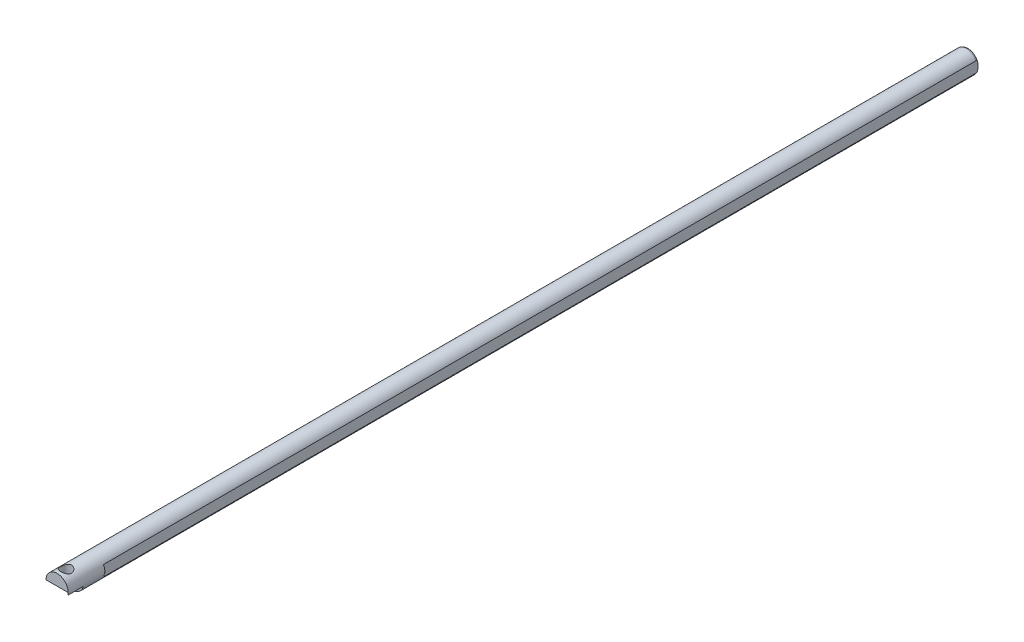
ISO-10303-21;
HEADER;
FILE_DESCRIPTION(('STEP AP214'),'2;1');
FILE_NAME('part.step','',(''),(''),'','','');
FILE_SCHEMA(('AUTOMOTIVE_DESIGN { 1 0 10303 214 1 1 1 1 }'));
ENDSEC;
DATA;
#1=APPLICATION_CONTEXT('core data for automotive mechanical design processes');
#2=APPLICATION_PROTOCOL_DEFINITION('international standard','automotive_design',2000,#1);
#3=PRODUCT_CONTEXT('',#1,'mechanical');
#4=PRODUCT('Part','Part','',(#3));
#5=PRODUCT_RELATED_PRODUCT_CATEGORY('part','',(#4));
#6=PRODUCT_DEFINITION_FORMATION('','',#4);
#7=PRODUCT_DEFINITION_CONTEXT('part definition',#1,'design');
#8=PRODUCT_DEFINITION('design','',#6,#7);
#9=PRODUCT_DEFINITION_SHAPE('','',#8);
#10=(LENGTH_UNIT() NAMED_UNIT(*) SI_UNIT(.MILLI.,.METRE.));
#11=(NAMED_UNIT(*) PLANE_ANGLE_UNIT() SI_UNIT($,.RADIAN.));
#12=(NAMED_UNIT(*) SI_UNIT($,.STERADIAN.) SOLID_ANGLE_UNIT());
#13=UNCERTAINTY_MEASURE_WITH_UNIT(LENGTH_MEASURE(1.E-05),#10,'distance_accuracy_value','');
#14=(GEOMETRIC_REPRESENTATION_CONTEXT(3) GLOBAL_UNCERTAINTY_ASSIGNED_CONTEXT((#13)) GLOBAL_UNIT_ASSIGNED_CONTEXT((#10,
#11,#12)) REPRESENTATION_CONTEXT('',''));
#15=CARTESIAN_POINT('',(0.,0.,0.));
#16=DIRECTION('',(0.,0.,1.));
#17=DIRECTION('',(1.,0.,0.));
#18=AXIS2_PLACEMENT_3D('',#15,#16,#17);
#19=CARTESIAN_POINT('',(0.,0.,82.));
#20=DIRECTION('',(0.,0.,-1.));
#21=DIRECTION('',(-1.,0.,0.));
#22=AXIS2_PLACEMENT_3D('',#19,#20,#21);
#23=CYLINDRICAL_SURFACE('',#22,0.999999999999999);
#24=CARTESIAN_POINT('',(0.,0.,82.));
#25=DIRECTION('',(0.,0.,1.));
#26=DIRECTION('',(1.,0.,0.));
#27=AXIS2_PLACEMENT_3D('',#24,#25,#26);
#28=CIRCLE('',#27,0.999999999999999);
#29=CARTESIAN_POINT('',(0.976913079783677,-0.213637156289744,82.));
#30=VERTEX_POINT('',#29);
#31=CARTESIAN_POINT('',(-0.999999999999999,0.,82.));
#32=VERTEX_POINT('',#31);
#33=EDGE_CURVE('E136',#30,#32,#28,.T.);
#34=ORIENTED_EDGE('',*,*,#33,.F.);
#35=DIRECTION('',(0.,0.,-1.));
#36=VECTOR('',#35,1.);
#37=CARTESIAN_POINT('',(0.976913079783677,-0.213637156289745,82.));
#38=LINE('',#37,#36);
#39=CARTESIAN_POINT('',(0.976913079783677,-0.213637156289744,80.6200613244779));
#40=VERTEX_POINT('',#39);
#41=EDGE_CURVE('E132',#30,#40,#38,.T.);
#42=ORIENTED_EDGE('',*,*,#41,.T.);
#43=CARTESIAN_POINT('',(0.,0.,80.6200613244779));
#44=DIRECTION('',(0.,0.,-1.));
#45=DIRECTION('',(-1.,0.,0.));
#46=AXIS2_PLACEMENT_3D('',#43,#44,#45);
#47=CIRCLE('',#46,0.999999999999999);
#48=CARTESIAN_POINT('',(-0.999999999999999,0.,80.6200613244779));
#49=VERTEX_POINT('',#48);
#50=EDGE_CURVE('E183',#40,#49,#47,.T.);
#51=ORIENTED_EDGE('',*,*,#50,.T.);
#52=DIRECTION('',(0.,0.,1.));
#53=VECTOR('',#52,1.);
#54=CARTESIAN_POINT('',(-0.999999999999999,0.,82.));
#55=LINE('',#54,#53);
#56=EDGE_CURVE('E117',#49,#32,#55,.T.);
#57=ORIENTED_EDGE('',*,*,#56,.T.);
#58=EDGE_LOOP('',(#34,#42,#51,#57));
#59=FACE_BOUND('',#58,.T.);
#60=CARTESIAN_POINT('',(0.,0.999999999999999,80.6998810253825));
#61=CARTESIAN_POINT('',(-0.0262859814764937,0.999998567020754,80.6998826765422));
#62=CARTESIAN_POINT('',(-0.0526032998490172,0.998952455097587,80.7019660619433));
#63=CARTESIAN_POINT('',(-0.104460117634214,0.99487078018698,80.7102074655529));
#64=CARTESIAN_POINT('',(-0.129998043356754,0.991831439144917,80.7163732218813));
#65=CARTESIAN_POINT('',(-0.179466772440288,0.984081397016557,80.7324779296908));
#66=CARTESIAN_POINT('',(-0.203403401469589,0.979377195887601,80.7424022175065));
#67=CARTESIAN_POINT('',(-0.249236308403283,0.968728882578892,80.7656663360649));
#68=CARTESIAN_POINT('',(-0.271132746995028,0.962784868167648,80.7790058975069));
#69=CARTESIAN_POINT('',(-0.31375390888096,0.949781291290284,80.8096396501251));
#70=CARTESIAN_POINT('',(-0.334327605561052,0.94267599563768,80.8271242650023));
#71=CARTESIAN_POINT('',(-0.372389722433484,0.928299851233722,80.865141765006));
#72=CARTESIAN_POINT('',(-0.389875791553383,0.921028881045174,80.8856769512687));
#73=CARTESIAN_POINT('',(-0.422626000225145,0.906494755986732,80.9311227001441));
#74=CARTESIAN_POINT('',(-0.437612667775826,0.899275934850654,80.9562490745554));
#75=CARTESIAN_POINT('',(-0.463084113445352,0.8864298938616,81.0090646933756));
#76=CARTESIAN_POINT('',(-0.473572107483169,0.880801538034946,81.0367520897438));
#77=CARTESIAN_POINT('',(-0.489066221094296,0.872289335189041,81.0922135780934));
#78=CARTESIAN_POINT('',(-0.494362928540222,0.869261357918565,81.1198832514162));
#79=CARTESIAN_POINT('',(-0.500213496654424,0.865909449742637,81.1758704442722));
#80=CARTESIAN_POINT('',(-0.500772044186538,0.865582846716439,81.204187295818));
#81=CARTESIAN_POINT('',(-0.497343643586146,0.867554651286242,81.2570240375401));
#82=CARTESIAN_POINT('',(-0.49389227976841,0.869543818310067,81.281593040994));
#83=CARTESIAN_POINT('',(-0.483469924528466,0.87538114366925,81.329741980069));
#84=CARTESIAN_POINT('',(-0.476497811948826,0.87922989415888,81.3533215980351));
#85=CARTESIAN_POINT('',(-0.459104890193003,0.888437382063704,81.3994955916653));
#86=CARTESIAN_POINT('',(-0.448607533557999,0.893829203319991,81.4220542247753));
#87=CARTESIAN_POINT('',(-0.424520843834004,0.905517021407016,81.4651981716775));
#88=CARTESIAN_POINT('',(-0.410930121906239,0.91181342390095,81.4857825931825));
#89=CARTESIAN_POINT('',(-0.379033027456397,0.925565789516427,81.5271416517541));
#90=CARTESIAN_POINT('',(-0.360347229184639,0.93306755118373,81.5476094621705));
#91=CARTESIAN_POINT('',(-0.319777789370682,0.947738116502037,81.5852487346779));
#92=CARTESIAN_POINT('',(-0.29789262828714,0.954906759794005,81.6024186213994));
#93=CARTESIAN_POINT('',(-0.25025825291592,0.96850993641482,81.6337238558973));
#94=CARTESIAN_POINT('',(-0.224376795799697,0.974894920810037,81.6476812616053));
#95=CARTESIAN_POINT('',(-0.170233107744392,0.985789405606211,81.670929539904));
#96=CARTESIAN_POINT('',(-0.141972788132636,0.990300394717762,81.68022411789));
#97=CARTESIAN_POINT('',(-0.086383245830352,0.996621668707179,81.6931187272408));
#98=CARTESIAN_POINT('',(-0.0591707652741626,0.998624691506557,81.6971266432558));
#99=CARTESIAN_POINT('',(-0.00438979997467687,1.00036506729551,81.7006133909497));
#100=CARTESIAN_POINT('',(0.0231785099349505,1.00010349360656,81.7000943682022));
#101=CARTESIAN_POINT('',(0.0756164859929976,0.997455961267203,81.6947776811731));
#102=CARTESIAN_POINT('',(0.100529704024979,0.995236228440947,81.6903147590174));
#103=CARTESIAN_POINT('',(0.149203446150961,0.989110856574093,81.6777619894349));
#104=CARTESIAN_POINT('',(0.1729638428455,0.985205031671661,81.6696717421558));
#105=CARTESIAN_POINT('',(0.219444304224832,0.975921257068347,81.6498817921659));
#106=CARTESIAN_POINT('',(0.242115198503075,0.970504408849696,81.638085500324));
#107=CARTESIAN_POINT('',(0.285230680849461,0.958719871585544,81.6113272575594));
#108=CARTESIAN_POINT('',(0.305674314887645,0.952351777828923,81.5963639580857));
#109=CARTESIAN_POINT('',(0.345883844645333,0.938541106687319,81.562000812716));
#110=CARTESIAN_POINT('',(0.365386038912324,0.931054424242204,81.5423095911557));
#111=CARTESIAN_POINT('',(0.400928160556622,0.91631195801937,81.4999184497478));
#112=CARTESIAN_POINT('',(0.416965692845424,0.909056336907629,81.4772164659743));
#113=CARTESIAN_POINT('',(0.445853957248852,0.895255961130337,81.4280591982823));
#114=CARTESIAN_POINT('',(0.458512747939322,0.888762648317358,81.4014753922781));
#115=CARTESIAN_POINT('',(0.479041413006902,0.877870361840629,81.3461259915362));
#116=CARTESIAN_POINT('',(0.486917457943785,0.873468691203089,81.3173632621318));
#117=CARTESIAN_POINT('',(0.49693084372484,0.867807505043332,81.2614259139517));
#118=CARTESIAN_POINT('',(0.499546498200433,0.866286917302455,81.2343638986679));
#119=CARTESIAN_POINT('',(0.500344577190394,0.865826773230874,81.1801574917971));
#120=CARTESIAN_POINT('',(0.4985289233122,0.866886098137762,81.1530131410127));
#121=CARTESIAN_POINT('',(0.49096306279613,0.871189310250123,81.1021392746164));
#122=CARTESIAN_POINT('',(0.485604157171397,0.874215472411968,81.0783307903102));
#123=CARTESIAN_POINT('',(0.47158767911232,0.881855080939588,81.0319769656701));
#124=CARTESIAN_POINT('',(0.462929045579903,0.886469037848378,81.0094320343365));
#125=CARTESIAN_POINT('',(0.441907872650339,0.897142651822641,80.9645685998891));
#126=CARTESIAN_POINT('',(0.429335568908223,0.903278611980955,80.9423670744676));
#127=CARTESIAN_POINT('',(0.40107548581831,0.916176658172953,80.9002437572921));
#128=CARTESIAN_POINT('',(0.385386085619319,0.922939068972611,80.8803231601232));
#129=CARTESIAN_POINT('',(0.349101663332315,0.937311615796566,80.8408100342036));
#130=CARTESIAN_POINT('',(0.328142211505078,0.944924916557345,80.8215514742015));
#131=CARTESIAN_POINT('',(0.283077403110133,0.95938876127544,80.7867495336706));
#132=CARTESIAN_POINT('',(0.25897036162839,0.966238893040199,80.7712081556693));
#133=CARTESIAN_POINT('',(0.207965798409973,0.978490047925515,80.7442628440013));
#134=CARTESIAN_POINT('',(0.181049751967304,0.983880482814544,80.7328889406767));
#135=CARTESIAN_POINT('',(0.12537105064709,0.992506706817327,80.714976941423));
#136=CARTESIAN_POINT('',(0.096613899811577,0.99574861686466,80.7084251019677));
#137=CARTESIAN_POINT('',(0.0563009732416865,0.998477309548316,80.7029323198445));
#138=CARTESIAN_POINT('',(0.0450809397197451,0.999046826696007,80.7017897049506));
#139=CARTESIAN_POINT('',(0.0225758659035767,0.999808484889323,80.700263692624));
#140=CARTESIAN_POINT('',(0.0112908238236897,1.00000061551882,80.6998803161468));
#141=CARTESIAN_POINT('',(0.,0.999999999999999,80.6998810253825));
#142=B_SPLINE_CURVE_WITH_KNOTS('',3,(#60,#61,#62,#63,#64,#65,#66,#67,#68,#69,#70,#71,#72,#73,
#74,#75,#76,#77,#78,#79,#80,#81,#82,#83,#84,#85,#86,#87,#88,#89,#90,#91,#92,#93,#94,#95,#96,#97,
#98,#99,#100,#101,#102,#103,#104,#105,#106,#107,#108,#109,#110,#111,#112,#113,#114,#115,#116,
#117,#118,#119,#120,#121,#122,#123,#124,#125,#126,#127,#128,#129,#130,#131,#132,#133,#134,#135,
#136,#137,#138,#139,#140,#141),.UNSPECIFIED.,.T.,.F.,(4,2,2,2,2,2,2,2,2,2,2,2,2,2,2,2,2,2,2,2,2,
2,2,2,2,2,2,2,2,2,2,2,2,2,2,2,2,2,2,2,4),(0.,0.0788121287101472,0.1577740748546,
0.236431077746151,0.315081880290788,0.398490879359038,0.481963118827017,0.571908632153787,
0.661789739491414,0.74629006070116,0.830706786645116,0.905028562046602,0.979374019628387,
1.05545120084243,1.13156260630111,1.21732470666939,1.30312767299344,1.39291511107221,
1.4826310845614,1.56491645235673,1.64716282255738,1.72303453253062,1.79891460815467,
1.8769642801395,1.9550472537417,2.04079805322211,2.12660794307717,2.21657341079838,
2.30642255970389,2.38764653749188,2.46883529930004,2.54228965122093,2.6157676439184,
2.69418228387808,2.77263780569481,2.8606262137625,2.94866191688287,3.03732006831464,
3.12572454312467,3.1595764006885,3.19342919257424),.UNSPECIFIED.);
#143=CARTESIAN_POINT('',(0.,0.999999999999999,80.6998810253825));
#144=VERTEX_POINT('',#143);
#145=EDGE_CURVE('E135',#144,#144,#142,.T.);
#146=ORIENTED_EDGE('',*,*,#145,.F.);
#147=EDGE_LOOP('',(#146));
#148=FACE_BOUND('',#147,.T.);
#149=DIRECTION('',(0.,0.,-1.));
#150=VECTOR('',#149,1.);
#151=CARTESIAN_POINT('',(-0.876913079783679,0.48064898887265,82.));
#152=LINE('',#151,#150);
#153=CARTESIAN_POINT('',(-0.876913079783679,0.480648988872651,78.7072974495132));
#154=VERTEX_POINT('',#153);
#155=CARTESIAN_POINT('',(-0.876913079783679,0.48064898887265,0.200000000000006));
#156=VERTEX_POINT('',#155);
#157=EDGE_CURVE('E49',#154,#156,#152,.T.);
#158=ORIENTED_EDGE('',*,*,#157,.F.);
#159=CARTESIAN_POINT('',(0.,0.,78.7072974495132));
#160=DIRECTION('',(0.,0.,-1.));
#161=DIRECTION('',(-1.,0.,0.));
#162=AXIS2_PLACEMENT_3D('',#159,#160,#161);
#163=CIRCLE('',#162,0.999999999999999);
#164=CARTESIAN_POINT('',(-0.876913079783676,-0.480648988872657,78.7072974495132));
#165=VERTEX_POINT('',#164);
#166=EDGE_CURVE('E11',#165,#154,#163,.T.);
#167=ORIENTED_EDGE('',*,*,#166,.F.);
#168=DIRECTION('',(0.,0.,-1.));
#169=VECTOR('',#168,1.);
#170=CARTESIAN_POINT('',(-0.876913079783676,-0.480648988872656,82.));
#171=LINE('',#170,#169);
#172=CARTESIAN_POINT('',(-0.876913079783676,-0.480648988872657,0.200000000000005));
#173=VERTEX_POINT('',#172);
#174=EDGE_CURVE('E92',#173,#165,#171,.F.);
#175=ORIENTED_EDGE('',*,*,#174,.F.);
#176=CARTESIAN_POINT('',(0.,0.,0.200000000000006));
#177=DIRECTION('',(0.,0.,1.));
#178=DIRECTION('',(1.,0.,0.));
#179=AXIS2_PLACEMENT_3D('',#176,#177,#178);
#180=CIRCLE('',#179,0.999999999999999);
#181=CARTESIAN_POINT('',(0.876913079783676,-0.480648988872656,0.200000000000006));
#182=VERTEX_POINT('',#181);
#183=EDGE_CURVE('E57',#173,#182,#180,.T.);
#184=ORIENTED_EDGE('',*,*,#183,.T.);
#185=DIRECTION('',(0.,0.,-1.));
#186=VECTOR('',#185,1.);
#187=CARTESIAN_POINT('',(0.876913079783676,-0.480648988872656,82.));
#188=LINE('',#187,#186);
#189=CARTESIAN_POINT('',(0.876913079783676,-0.480648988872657,78.7072974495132));
#190=VERTEX_POINT('',#189);
#191=EDGE_CURVE('E115',#190,#182,#188,.T.);
#192=ORIENTED_EDGE('',*,*,#191,.F.);
#193=CARTESIAN_POINT('',(0.,0.,78.7072974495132));
#194=DIRECTION('',(0.,0.,1.));
#195=DIRECTION('',(1.,0.,0.));
#196=AXIS2_PLACEMENT_3D('',#193,#194,#195);
#197=CIRCLE('',#196,0.999999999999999);
#198=CARTESIAN_POINT('',(0.876913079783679,0.480648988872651,78.7072974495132));
#199=VERTEX_POINT('',#198);
#200=EDGE_CURVE('E192',#190,#199,#197,.T.);
#201=ORIENTED_EDGE('',*,*,#200,.T.);
#202=DIRECTION('',(0.,0.,-1.));
#203=VECTOR('',#202,1.);
#204=CARTESIAN_POINT('',(0.876913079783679,0.48064898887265,82.));
#205=LINE('',#204,#203);
#206=CARTESIAN_POINT('',(0.876913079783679,0.480648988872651,0.200000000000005));
#207=VERTEX_POINT('',#206);
#208=EDGE_CURVE('E111',#207,#199,#205,.F.);
#209=ORIENTED_EDGE('',*,*,#208,.F.);
#210=EDGE_CURVE('E104',#207,#156,#180,.T.);
#211=ORIENTED_EDGE('',*,*,#210,.T.);
#212=EDGE_LOOP('',(#158,#167,#175,#184,#192,#201,#209,#211));
#213=FACE_BOUND('',#212,.T.);
#214=ADVANCED_FACE('F34',(#59,#148,#213),#23,.T.);
#215=CARTESIAN_POINT('',(0.,0.,0.200000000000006));
#216=DIRECTION('',(0.,0.,1.));
#217=DIRECTION('',(1.,0.,0.));
#218=AXIS2_PLACEMENT_3D('',#215,#216,#217);
#219=TOROIDAL_SURFACE('',#218,0.799999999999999,0.2);
#220=CARTESIAN_POINT('',(0.,0.,0.));
#221=DIRECTION('',(0.,0.,1.));
#222=DIRECTION('',(1.,0.,0.));
#223=AXIS2_PLACEMENT_3D('',#220,#221,#222);
#224=CIRCLE('',#223,0.799999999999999);
#225=CARTESIAN_POINT('',(0.799999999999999,0.,0.));
#226=VERTEX_POINT('',#225);
#227=EDGE_CURVE('E179',#226,#226,#224,.F.);
#228=ORIENTED_EDGE('',*,*,#227,.F.);
#229=EDGE_LOOP('',(#228));
#230=FACE_BOUND('',#229,.T.);
#231=ORIENTED_EDGE('',*,*,#183,.F.);
#232=CARTESIAN_POINT('',(-0.876913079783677,0.,0.0153804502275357));
#233=CARTESIAN_POINT('',(-0.876913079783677,0.0217630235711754,0.0153810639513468));
#234=CARTESIAN_POINT('',(-0.876913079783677,0.0435258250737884,0.0157124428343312));
#235=CARTESIAN_POINT('',(-0.876913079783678,0.0870274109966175,0.0171076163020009));
#236=CARTESIAN_POINT('',(-0.876913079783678,0.108766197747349,0.018171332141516));
#237=CARTESIAN_POINT('',(-0.876913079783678,0.152144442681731,0.0212362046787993));
#238=CARTESIAN_POINT('',(-0.876913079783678,0.17378400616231,0.0232357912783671));
#239=CARTESIAN_POINT('',(-0.876913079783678,0.216896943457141,0.0285336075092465));
#240=CARTESIAN_POINT('',(-0.876913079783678,0.238370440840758,0.0318307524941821));
#241=CARTESIAN_POINT('',(-0.876913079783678,0.281145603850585,0.0403146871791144));
#242=CARTESIAN_POINT('',(-0.876913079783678,0.302444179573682,0.0455175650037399));
#243=CARTESIAN_POINT('',(-0.876913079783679,0.344167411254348,0.0586507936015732));
#244=CARTESIAN_POINT('',(-0.876913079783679,0.364595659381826,0.06656839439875));
#245=CARTESIAN_POINT('',(-0.876913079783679,0.392416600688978,0.0807907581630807));
#246=CARTESIAN_POINT('',(-0.876913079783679,0.400635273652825,0.0854662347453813));
#247=CARTESIAN_POINT('',(-0.876913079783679,0.416515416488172,0.0957278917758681));
#248=CARTESIAN_POINT('',(-0.876913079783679,0.42417593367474,0.101315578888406));
#249=CARTESIAN_POINT('',(-0.876913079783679,0.438731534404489,0.113619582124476));
#250=CARTESIAN_POINT('',(-0.876913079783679,0.445614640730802,0.120350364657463));
#251=CARTESIAN_POINT('',(-0.876913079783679,0.457998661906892,0.134981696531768));
#252=CARTESIAN_POINT('',(-0.876913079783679,0.463505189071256,0.142877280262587));
#253=CARTESIAN_POINT('',(-0.876913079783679,0.470741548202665,0.15645007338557));
#254=CARTESIAN_POINT('',(-0.876913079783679,0.473106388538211,0.161788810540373));
#255=CARTESIAN_POINT('',(-0.876913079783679,0.476932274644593,0.172782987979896));
#256=CARTESIAN_POINT('',(-0.876913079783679,0.478394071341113,0.178438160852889));
#257=CARTESIAN_POINT('',(-0.876913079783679,0.480298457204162,0.189951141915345));
#258=CARTESIAN_POINT('',(-0.876913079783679,0.480735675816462,0.195809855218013));
#259=CARTESIAN_POINT('',(-0.876913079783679,0.480533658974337,0.207508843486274));
#260=CARTESIAN_POINT('',(-0.876913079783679,0.479894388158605,0.213349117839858));
#261=CARTESIAN_POINT('',(-0.876913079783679,0.477679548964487,0.224423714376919));
#262=CARTESIAN_POINT('',(-0.876913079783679,0.476171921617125,0.229671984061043));
#263=CARTESIAN_POINT('',(-0.876913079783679,0.472384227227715,0.239878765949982));
#264=CARTESIAN_POINT('',(-0.876913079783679,0.470103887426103,0.24483717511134));
#265=CARTESIAN_POINT('',(-0.876913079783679,0.463735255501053,0.256535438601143));
#266=CARTESIAN_POINT('',(-0.876913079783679,0.459294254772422,0.263083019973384));
#267=CARTESIAN_POINT('',(-0.876913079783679,0.449427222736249,0.275388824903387));
#268=CARTESIAN_POINT('',(-0.876913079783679,0.443998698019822,0.281144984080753));
#269=CARTESIAN_POINT('',(-0.876913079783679,0.429093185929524,0.29503248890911));
#270=CARTESIAN_POINT('',(-0.876913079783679,0.419096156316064,0.302601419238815));
#271=CARTESIAN_POINT('',(-0.876913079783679,0.398109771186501,0.316168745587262));
#272=CARTESIAN_POINT('',(-0.876913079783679,0.387118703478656,0.322164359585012));
#273=CARTESIAN_POINT('',(-0.876913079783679,0.35375563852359,0.33805165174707));
#274=CARTESIAN_POINT('',(-0.876913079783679,0.330557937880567,0.3461810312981));
#275=CARTESIAN_POINT('',(-0.876913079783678,0.283293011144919,0.359365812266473));
#276=CARTESIAN_POINT('',(-0.876913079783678,0.259222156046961,0.364406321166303));
#277=CARTESIAN_POINT('',(-0.876913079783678,0.199000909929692,0.37439918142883));
#278=CARTESIAN_POINT('',(-0.876913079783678,0.1626548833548,0.378122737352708));
#279=CARTESIAN_POINT('',(-0.876913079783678,0.0897546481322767,0.383058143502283));
#280=CARTESIAN_POINT('',(-0.876913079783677,0.0532001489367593,0.384263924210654));
#281=CARTESIAN_POINT('',(-0.876913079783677,-0.019984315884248,0.384843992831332));
#282=CARTESIAN_POINT('',(-0.876913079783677,-0.0566143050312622,0.384215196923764));
#283=CARTESIAN_POINT('',(-0.876913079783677,-0.129726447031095,0.380754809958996));
#284=CARTESIAN_POINT('',(-0.876913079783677,-0.166208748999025,0.377927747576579));
#285=CARTESIAN_POINT('',(-0.876913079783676,-0.229382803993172,0.369716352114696));
#286=CARTESIAN_POINT('',(-0.876913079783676,-0.256179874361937,0.365176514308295));
#287=CARTESIAN_POINT('',(-0.876913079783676,-0.308924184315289,0.352841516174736));
#288=CARTESIAN_POINT('',(-0.876913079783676,-0.334876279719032,0.345070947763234));
#289=CARTESIAN_POINT('',(-0.876913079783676,-0.368927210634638,0.330872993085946));
#290=CARTESIAN_POINT('',(-0.876913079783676,-0.377953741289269,0.326694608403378));
#291=CARTESIAN_POINT('',(-0.876913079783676,-0.395581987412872,0.317465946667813));
#292=CARTESIAN_POINT('',(-0.876913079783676,-0.404182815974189,0.312413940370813));
#293=CARTESIAN_POINT('',(-0.876913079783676,-0.420787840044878,0.301231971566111));
#294=CARTESIAN_POINT('',(-0.876913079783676,-0.428785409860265,0.295091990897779));
#295=CARTESIAN_POINT('',(-0.876913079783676,-0.443690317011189,0.281604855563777));
#296=CARTESIAN_POINT('',(-0.876913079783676,-0.450600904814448,0.274261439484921));
#297=CARTESIAN_POINT('',(-0.876913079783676,-0.46050098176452,0.261241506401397));
#298=CARTESIAN_POINT('',(-0.876913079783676,-0.463995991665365,0.255951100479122));
#299=CARTESIAN_POINT('',(-0.876913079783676,-0.470125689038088,0.244888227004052));
#300=CARTESIAN_POINT('',(-0.876913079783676,-0.472760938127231,0.239116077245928));
#301=CARTESIAN_POINT('',(-0.876913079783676,-0.476990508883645,0.227131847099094));
#302=CARTESIAN_POINT('',(-0.876913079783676,-0.478574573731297,0.220916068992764));
#303=CARTESIAN_POINT('',(-0.876913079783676,-0.480499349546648,0.208295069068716));
#304=CARTESIAN_POINT('',(-0.876913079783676,-0.480841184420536,0.201890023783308));
#305=CARTESIAN_POINT('',(-0.876913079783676,-0.480284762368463,0.189940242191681));
#306=CARTESIAN_POINT('',(-0.876913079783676,-0.479535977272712,0.184387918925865));
#307=CARTESIAN_POINT('',(-0.876913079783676,-0.477125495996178,0.173486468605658));
#308=CARTESIAN_POINT('',(-0.876913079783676,-0.475463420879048,0.168137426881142));
#309=CARTESIAN_POINT('',(-0.876913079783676,-0.470833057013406,0.156470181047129));
#310=CARTESIAN_POINT('',(-0.876913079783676,-0.467643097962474,0.15024045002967));
#311=CARTESIAN_POINT('',(-0.876913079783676,-0.460295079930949,0.138383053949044));
#312=CARTESIAN_POINT('',(-0.876913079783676,-0.456135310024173,0.132756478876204));
#313=CARTESIAN_POINT('',(-0.876913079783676,-0.444935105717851,0.119584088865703));
#314=CARTESIAN_POINT('',(-0.876913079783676,-0.437467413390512,0.112404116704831));
#315=CARTESIAN_POINT('',(-0.876913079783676,-0.421533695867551,0.0992693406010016));
#316=CARTESIAN_POINT('',(-0.876913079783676,-0.413065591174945,0.0933171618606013));
#317=CARTESIAN_POINT('',(-0.876913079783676,-0.388501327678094,0.0781193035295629));
#318=CARTESIAN_POINT('',(-0.876913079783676,-0.371700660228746,0.0700253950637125));
#319=CARTESIAN_POINT('',(-0.876913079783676,-0.337159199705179,0.0562361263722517));
#320=CARTESIAN_POINT('',(-0.876913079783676,-0.319415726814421,0.0505480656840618));
#321=CARTESIAN_POINT('',(-0.876913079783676,-0.27706872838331,0.0391875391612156));
#322=CARTESIAN_POINT('',(-0.876913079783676,-0.252274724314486,0.0342435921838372));
#323=CARTESIAN_POINT('',(-0.876913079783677,-0.20234816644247,0.0264270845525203));
#324=CARTESIAN_POINT('',(-0.876913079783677,-0.177215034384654,0.0235586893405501));
#325=CARTESIAN_POINT('',(-0.876913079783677,-0.126741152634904,0.0192151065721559));
#326=CARTESIAN_POINT('',(-0.876913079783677,-0.101399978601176,0.017745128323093));
#327=CARTESIAN_POINT('',(-0.876913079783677,-0.0507057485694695,0.0158279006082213));
#328=CARTESIAN_POINT('',(-0.876913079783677,-0.0253527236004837,0.0153797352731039));
#329=CARTESIAN_POINT('',(-0.876913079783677,0.,0.0153804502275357));
#330=B_SPLINE_CURVE_WITH_KNOTS('',3,(#232,#233,#234,#235,#236,#237,#238,#239,#240,#241,#242,
#243,#244,#245,#246,#247,#248,#249,#250,#251,#252,#253,#254,#255,#256,#257,#258,#259,#260,#261,
#262,#263,#264,#265,#266,#267,#268,#269,#270,#271,#272,#273,#274,#275,#276,#277,#278,#279,#280,
#281,#282,#283,#284,#285,#286,#287,#288,#289,#290,#291,#292,#293,#294,#295,#296,#297,#298,#299,
#300,#301,#302,#303,#304,#305,#306,#307,#308,#309,#310,#311,#312,#313,#314,#315,#316,#317,#318,
#319,#320,#321,#322,#323,#324,#325,#326,#327,#328,#329),.UNSPECIFIED.,.T.,.F.,(4,2,2,2,2,2,2,2,
2,2,2,2,2,2,2,2,2,2,2,2,2,2,2,2,2,2,2,2,2,2,2,2,2,2,2,2,2,2,2,2,2,2,2,2,2,2,2,2,4),(0.,
0.0652859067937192,0.130564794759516,0.195734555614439,0.260849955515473,0.326528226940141,
0.391902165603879,0.42022378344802,0.448592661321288,0.477351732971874,0.50599156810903,
0.5234421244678,0.540878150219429,0.558405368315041,0.575933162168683,0.592246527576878,
0.608565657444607,0.632166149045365,0.655827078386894,0.693231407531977,0.73070143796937,
0.804029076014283,0.877707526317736,0.987125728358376,1.09680739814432,1.20667354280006,
1.31631394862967,1.39776167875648,1.47860047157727,1.50840504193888,1.53826929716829,
1.56842437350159,1.59848748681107,1.61744682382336,1.63639375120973,1.65552293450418,
1.67463480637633,1.69136097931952,1.70809409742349,1.7289754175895,1.74989385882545,
1.78079713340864,1.81176581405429,1.86739559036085,1.92319296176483,1.99888279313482,
2.07472410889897,2.15084685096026,2.22690133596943),.UNSPECIFIED.);
#331=EDGE_CURVE('E42',#173,#156,#330,.T.);
#332=ORIENTED_EDGE('',*,*,#331,.T.);
#333=ORIENTED_EDGE('',*,*,#210,.F.);
#334=CARTESIAN_POINT('',(0.876913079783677,0.,0.0153804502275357));
#335=CARTESIAN_POINT('',(0.876913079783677,-0.0217630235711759,0.0153810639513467));
#336=CARTESIAN_POINT('',(0.876913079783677,-0.0435258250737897,0.0157124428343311));
#337=CARTESIAN_POINT('',(0.876913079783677,-0.0870274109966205,0.0171076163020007));
#338=CARTESIAN_POINT('',(0.876913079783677,-0.108766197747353,0.0181713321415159));
#339=CARTESIAN_POINT('',(0.876913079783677,-0.152144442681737,0.0212362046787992));
#340=CARTESIAN_POINT('',(0.876913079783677,-0.173784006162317,0.0232357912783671));
#341=CARTESIAN_POINT('',(0.876913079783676,-0.21689694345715,0.0285336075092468));
#342=CARTESIAN_POINT('',(0.876913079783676,-0.238370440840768,0.0318307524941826));
#343=CARTESIAN_POINT('',(0.876913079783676,-0.281145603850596,0.0403146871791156));
#344=CARTESIAN_POINT('',(0.876913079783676,-0.302444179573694,0.0455175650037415));
#345=CARTESIAN_POINT('',(0.876913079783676,-0.344167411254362,0.058650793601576));
#346=CARTESIAN_POINT('',(0.876913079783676,-0.364595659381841,0.0665683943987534));
#347=CARTESIAN_POINT('',(0.876913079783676,-0.392416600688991,0.0807907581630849));
#348=CARTESIAN_POINT('',(0.876913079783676,-0.400635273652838,0.0854662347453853));
#349=CARTESIAN_POINT('',(0.876913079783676,-0.416515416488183,0.0957278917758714));
#350=CARTESIAN_POINT('',(0.876913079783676,-0.42417593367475,0.101315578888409));
#351=CARTESIAN_POINT('',(0.876913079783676,-0.438731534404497,0.113619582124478));
#352=CARTESIAN_POINT('',(0.876913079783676,-0.44561464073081,0.120350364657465));
#353=CARTESIAN_POINT('',(0.876913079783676,-0.457998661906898,0.134981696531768));
#354=CARTESIAN_POINT('',(0.876913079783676,-0.463505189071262,0.142877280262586));
#355=CARTESIAN_POINT('',(0.876913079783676,-0.47074154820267,0.156450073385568));
#356=CARTESIAN_POINT('',(0.876913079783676,-0.473106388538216,0.161788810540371));
#357=CARTESIAN_POINT('',(0.876913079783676,-0.476932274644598,0.172782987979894));
#358=CARTESIAN_POINT('',(0.876913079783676,-0.478394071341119,0.178438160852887));
#359=CARTESIAN_POINT('',(0.876913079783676,-0.480298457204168,0.189951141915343));
#360=CARTESIAN_POINT('',(0.876913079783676,-0.480735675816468,0.195809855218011));
#361=CARTESIAN_POINT('',(0.876913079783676,-0.480533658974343,0.207508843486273));
#362=CARTESIAN_POINT('',(0.876913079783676,-0.479894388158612,0.213349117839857));
#363=CARTESIAN_POINT('',(0.876913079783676,-0.477679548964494,0.224423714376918));
#364=CARTESIAN_POINT('',(0.876913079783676,-0.476171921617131,0.229671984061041));
#365=CARTESIAN_POINT('',(0.876913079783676,-0.472384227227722,0.23987876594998));
#366=CARTESIAN_POINT('',(0.876913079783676,-0.47010388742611,0.244837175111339));
#367=CARTESIAN_POINT('',(0.876913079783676,-0.46373525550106,0.256535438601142));
#368=CARTESIAN_POINT('',(0.876913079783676,-0.459294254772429,0.263083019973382));
#369=CARTESIAN_POINT('',(0.876913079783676,-0.449427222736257,0.275388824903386));
#370=CARTESIAN_POINT('',(0.876913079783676,-0.44399869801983,0.281144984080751));
#371=CARTESIAN_POINT('',(0.876913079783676,-0.429093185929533,0.295032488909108));
#372=CARTESIAN_POINT('',(0.876913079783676,-0.419096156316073,0.302601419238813));
#373=CARTESIAN_POINT('',(0.876913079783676,-0.39810977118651,0.31616874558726));
#374=CARTESIAN_POINT('',(0.876913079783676,-0.387118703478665,0.32216435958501));
#375=CARTESIAN_POINT('',(0.876913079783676,-0.353755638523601,0.338051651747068));
#376=CARTESIAN_POINT('',(0.876913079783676,-0.330557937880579,0.346181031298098));
#377=CARTESIAN_POINT('',(0.876913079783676,-0.283293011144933,0.359365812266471));
#378=CARTESIAN_POINT('',(0.876913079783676,-0.259222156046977,0.364406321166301));
#379=CARTESIAN_POINT('',(0.876913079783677,-0.199000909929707,0.374399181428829));
#380=CARTESIAN_POINT('',(0.876913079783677,-0.162654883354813,0.378122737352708));
#381=CARTESIAN_POINT('',(0.876913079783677,-0.0897546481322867,0.383058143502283));
#382=CARTESIAN_POINT('',(0.876913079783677,-0.0532001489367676,0.384263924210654));
#383=CARTESIAN_POINT('',(0.876913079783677,0.0199843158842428,0.384843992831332));
#384=CARTESIAN_POINT('',(0.876913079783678,0.0566143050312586,0.384215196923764));
#385=CARTESIAN_POINT('',(0.876913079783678,0.129726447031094,0.380754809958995));
#386=CARTESIAN_POINT('',(0.876913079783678,0.166208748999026,0.377927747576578));
#387=CARTESIAN_POINT('',(0.876913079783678,0.229382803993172,0.369716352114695));
#388=CARTESIAN_POINT('',(0.876913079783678,0.256179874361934,0.365176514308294));
#389=CARTESIAN_POINT('',(0.876913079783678,0.30892418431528,0.352841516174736));
#390=CARTESIAN_POINT('',(0.876913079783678,0.334876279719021,0.345070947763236));
#391=CARTESIAN_POINT('',(0.876913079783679,0.368927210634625,0.330872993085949));
#392=CARTESIAN_POINT('',(0.876913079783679,0.377953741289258,0.32669460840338));
#393=CARTESIAN_POINT('',(0.876913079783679,0.395581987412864,0.317465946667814));
#394=CARTESIAN_POINT('',(0.876913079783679,0.404182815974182,0.312413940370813));
#395=CARTESIAN_POINT('',(0.876913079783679,0.420787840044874,0.30123197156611));
#396=CARTESIAN_POINT('',(0.876913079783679,0.428785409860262,0.295091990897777));
#397=CARTESIAN_POINT('',(0.876913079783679,0.443690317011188,0.281604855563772));
#398=CARTESIAN_POINT('',(0.876913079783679,0.450600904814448,0.274261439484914));
#399=CARTESIAN_POINT('',(0.876913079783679,0.460500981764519,0.261241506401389));
#400=CARTESIAN_POINT('',(0.876913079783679,0.463995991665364,0.255951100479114));
#401=CARTESIAN_POINT('',(0.876913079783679,0.470125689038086,0.244888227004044));
#402=CARTESIAN_POINT('',(0.876913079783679,0.472760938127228,0.23911607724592));
#403=CARTESIAN_POINT('',(0.876913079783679,0.476990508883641,0.227131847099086));
#404=CARTESIAN_POINT('',(0.876913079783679,0.478574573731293,0.220916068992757));
#405=CARTESIAN_POINT('',(0.876913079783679,0.480499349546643,0.208295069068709));
#406=CARTESIAN_POINT('',(0.876913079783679,0.480841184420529,0.201890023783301));
#407=CARTESIAN_POINT('',(0.876913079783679,0.480284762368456,0.189940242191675));
#408=CARTESIAN_POINT('',(0.876913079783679,0.479535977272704,0.184387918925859));
#409=CARTESIAN_POINT('',(0.876913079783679,0.47712549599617,0.173486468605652));
#410=CARTESIAN_POINT('',(0.876913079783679,0.47546342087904,0.168137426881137));
#411=CARTESIAN_POINT('',(0.876913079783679,0.470833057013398,0.156470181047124));
#412=CARTESIAN_POINT('',(0.876913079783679,0.467643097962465,0.150240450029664));
#413=CARTESIAN_POINT('',(0.876913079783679,0.46029507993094,0.138383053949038));
#414=CARTESIAN_POINT('',(0.876913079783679,0.456135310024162,0.132756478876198));
#415=CARTESIAN_POINT('',(0.876913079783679,0.444935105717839,0.119584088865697));
#416=CARTESIAN_POINT('',(0.876913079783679,0.4374674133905,0.112404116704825));
#417=CARTESIAN_POINT('',(0.876913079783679,0.421533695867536,0.0992693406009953));
#418=CARTESIAN_POINT('',(0.876913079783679,0.41306559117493,0.0933171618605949));
#419=CARTESIAN_POINT('',(0.876913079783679,0.388501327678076,0.0781193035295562));
#420=CARTESIAN_POINT('',(0.876913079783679,0.371700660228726,0.0700253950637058));
#421=CARTESIAN_POINT('',(0.876913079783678,0.337159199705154,0.0562361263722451));
#422=CARTESIAN_POINT('',(0.876913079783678,0.319415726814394,0.0505480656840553));
#423=CARTESIAN_POINT('',(0.876913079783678,0.277068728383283,0.039187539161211));
#424=CARTESIAN_POINT('',(0.876913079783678,0.252274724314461,0.0342435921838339));
#425=CARTESIAN_POINT('',(0.876913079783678,0.20234816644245,0.0264270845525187));
#426=CARTESIAN_POINT('',(0.876913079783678,0.177215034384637,0.023558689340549));
#427=CARTESIAN_POINT('',(0.876913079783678,0.126741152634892,0.0192151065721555));
#428=CARTESIAN_POINT('',(0.876913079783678,0.101399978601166,0.0177451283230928));
#429=CARTESIAN_POINT('',(0.876913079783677,0.0507057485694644,0.0158279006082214));
#430=CARTESIAN_POINT('',(0.876913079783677,0.0253527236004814,0.015379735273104));
#431=CARTESIAN_POINT('',(0.876913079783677,0.,0.0153804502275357));
#432=B_SPLINE_CURVE_WITH_KNOTS('',3,(#334,#335,#336,#337,#338,#339,#340,#341,#342,#343,#344,
#345,#346,#347,#348,#349,#350,#351,#352,#353,#354,#355,#356,#357,#358,#359,#360,#361,#362,#363,
#364,#365,#366,#367,#368,#369,#370,#371,#372,#373,#374,#375,#376,#377,#378,#379,#380,#381,#382,
#383,#384,#385,#386,#387,#388,#389,#390,#391,#392,#393,#394,#395,#396,#397,#398,#399,#400,#401,
#402,#403,#404,#405,#406,#407,#408,#409,#410,#411,#412,#413,#414,#415,#416,#417,#418,#419,#420,
#421,#422,#423,#424,#425,#426,#427,#428,#429,#430,#431),.UNSPECIFIED.,.T.,.F.,(4,2,2,2,2,2,2,2,
2,2,2,2,2,2,2,2,2,2,2,2,2,2,2,2,2,2,2,2,2,2,2,2,2,2,2,2,2,2,2,2,2,2,2,2,2,2,2,2,4),(0.,
0.0652859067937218,0.130564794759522,0.195734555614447,0.260849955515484,0.326528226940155,
0.391902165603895,0.420223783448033,0.448592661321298,0.477351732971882,0.505991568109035,
0.523442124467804,0.540878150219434,0.558405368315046,0.575933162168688,0.592246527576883,
0.608565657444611,0.632166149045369,0.655827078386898,0.69323140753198,0.730701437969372,
0.804029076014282,0.877707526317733,0.987125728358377,1.09680739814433,1.20667354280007,
1.31631394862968,1.39776167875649,1.47860047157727,1.50840504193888,1.5382692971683,
1.5684243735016,1.59848748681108,1.61744682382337,1.63639375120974,1.65552293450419,
1.67463480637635,1.69136097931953,1.7080940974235,1.72897541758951,1.74989385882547,
1.78079713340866,1.81176581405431,1.86739559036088,1.92319296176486,1.99888279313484,
2.07472410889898,2.15084685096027,2.22690133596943),.UNSPECIFIED.);
#433=EDGE_CURVE('E186',#207,#182,#432,.T.);
#434=ORIENTED_EDGE('',*,*,#433,.T.);
#435=EDGE_LOOP('',(#231,#332,#333,#434));
#436=FACE_BOUND('',#435,.T.);
#437=ADVANCED_FACE('F151',(#230,#436),#219,.T.);
#438=CARTESIAN_POINT('',(0.,82.,81.1998810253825));
#439=DIRECTION('',(0.,-1.,0.));
#440=DIRECTION('',(0.,0.,-1.));
#441=AXIS2_PLACEMENT_3D('',#438,#439,#440);
#442=CYLINDRICAL_SURFACE('',#441,0.5);
#443=ORIENTED_EDGE('',*,*,#145,.T.);
#444=EDGE_LOOP('',(#443));
#445=FACE_BOUND('',#444,.T.);
#446=CARTESIAN_POINT('',(0.,0.,81.1998810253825));
#447=DIRECTION('',(0.,-1.,0.));
#448=DIRECTION('',(0.,0.,-1.));
#449=AXIS2_PLACEMENT_3D('',#446,#447,#448);
#450=CIRCLE('',#449,0.5);
#451=CARTESIAN_POINT('',(0.,0.,80.6998810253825));
#452=VERTEX_POINT('',#451);
#453=EDGE_CURVE('E131',#452,#452,#450,.T.);
#454=ORIENTED_EDGE('',*,*,#453,.T.);
#455=EDGE_LOOP('',(#454));
#456=FACE_BOUND('',#455,.T.);
#457=ADVANCED_FACE('F145',(#445,#456),#442,.F.);
#458=CARTESIAN_POINT('',(0.,0.,82.));
#459=DIRECTION('',(0.,0.,1.));
#460=DIRECTION('',(1.,0.,0.));
#461=AXIS2_PLACEMENT_3D('',#458,#459,#460);
#462=PLANE('',#461);
#463=DIRECTION('',(0.,1.,0.));
#464=VECTOR('',#463,1.);
#465=CARTESIAN_POINT('',(0.976913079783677,0.,82.));
#466=LINE('',#465,#464);
#467=CARTESIAN_POINT('',(0.976913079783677,0.,82.));
#468=VERTEX_POINT('',#467);
#469=EDGE_CURVE('E180',#30,#468,#466,.T.);
#470=ORIENTED_EDGE('',*,*,#469,.F.);
#471=ORIENTED_EDGE('',*,*,#33,.T.);
#472=DIRECTION('',(1.,0.,0.));
#473=VECTOR('',#472,1.);
#474=CARTESIAN_POINT('',(-0.999999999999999,0.,82.));
#475=LINE('',#474,#473);
#476=EDGE_CURVE('E120',#32,#468,#475,.T.);
#477=ORIENTED_EDGE('',*,*,#476,.T.);
#478=EDGE_LOOP('',(#470,#471,#477));
#479=FACE_BOUND('',#478,.T.);
#480=ADVANCED_FACE('F150',(#479),#462,.T.);
#481=CARTESIAN_POINT('',(0.,0.,0.));
#482=DIRECTION('',(0.,0.,1.));
#483=DIRECTION('',(1.,0.,0.));
#484=AXIS2_PLACEMENT_3D('',#481,#482,#483);
#485=PLANE('',#484);
#486=ORIENTED_EDGE('',*,*,#227,.T.);
#487=EDGE_LOOP('',(#486));
#488=FACE_BOUND('',#487,.T.);
#489=ADVANCED_FACE('F155',(#488),#485,.F.);
#490=CARTESIAN_POINT('',(-0.999999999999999,-10.,80.6200613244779));
#491=DIRECTION('',(0.,0.,-1.));
#492=DIRECTION('',(-1.,0.,0.));
#493=AXIS2_PLACEMENT_3D('',#490,#491,#492);
#494=PLANE('',#493);
#495=DIRECTION('',(0.,1.,0.));
#496=VECTOR('',#495,1.);
#497=CARTESIAN_POINT('',(0.976913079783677,-10.,80.6200613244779));
#498=LINE('',#497,#496);
#499=CARTESIAN_POINT('',(0.976913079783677,0.,80.6200613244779));
#500=VERTEX_POINT('',#499);
#501=EDGE_CURVE('E129',#40,#500,#498,.T.);
#502=ORIENTED_EDGE('',*,*,#501,.T.);
#503=DIRECTION('',(-1.,0.,0.));
#504=VECTOR('',#503,1.);
#505=CARTESIAN_POINT('',(-0.999999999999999,0.,80.6200613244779));
#506=LINE('',#505,#504);
#507=EDGE_CURVE('E126',#500,#49,#506,.T.);
#508=ORIENTED_EDGE('',*,*,#507,.T.);
#509=ORIENTED_EDGE('',*,*,#50,.F.);
#510=EDGE_LOOP('',(#502,#508,#509));
#511=FACE_BOUND('',#510,.T.);
#512=ADVANCED_FACE('F157',(#511),#494,.F.);
#513=CARTESIAN_POINT('',(0.976913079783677,-10.,82.));
#514=DIRECTION('',(1.,0.,0.));
#515=DIRECTION('',(0.,0.,-1.));
#516=AXIS2_PLACEMENT_3D('',#513,#514,#515);
#517=PLANE('',#516);
#518=ORIENTED_EDGE('',*,*,#469,.T.);
#519=DIRECTION('',(0.,0.,-1.));
#520=VECTOR('',#519,1.);
#521=CARTESIAN_POINT('',(0.976913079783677,0.,82.));
#522=LINE('',#521,#520);
#523=EDGE_CURVE('E123',#468,#500,#522,.T.);
#524=ORIENTED_EDGE('',*,*,#523,.T.);
#525=ORIENTED_EDGE('',*,*,#501,.F.);
#526=ORIENTED_EDGE('',*,*,#41,.F.);
#527=EDGE_LOOP('',(#518,#524,#525,#526));
#528=FACE_BOUND('',#527,.T.);
#529=ADVANCED_FACE('F207',(#528),#517,.F.);
#530=CARTESIAN_POINT('',(-0.999999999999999,0.,80.6200613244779));
#531=DIRECTION('',(0.,-1.,0.));
#532=DIRECTION('',(0.,0.,-1.));
#533=AXIS2_PLACEMENT_3D('',#530,#531,#532);
#534=PLANE('',#533);
#535=ORIENTED_EDGE('',*,*,#453,.F.);
#536=EDGE_LOOP('',(#535));
#537=FACE_BOUND('',#536,.T.);
#538=ORIENTED_EDGE('',*,*,#56,.F.);
#539=ORIENTED_EDGE('',*,*,#507,.F.);
#540=ORIENTED_EDGE('',*,*,#523,.F.);
#541=ORIENTED_EDGE('',*,*,#476,.F.);
#542=EDGE_LOOP('',(#538,#539,#540,#541));
#543=FACE_BOUND('',#542,.T.);
#544=ADVANCED_FACE('F203',(#537,#543),#534,.T.);
#545=CARTESIAN_POINT('',(1.07691307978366,-4.62627725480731,78.7072974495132));
#546=DIRECTION('',(0.,0.,1.));
#547=DIRECTION('',(1.,0.,0.));
#548=AXIS2_PLACEMENT_3D('',#545,#546,#547);
#549=PLANE('',#548);
#550=DIRECTION('',(0.,1.,0.));
#551=VECTOR('',#550,1.);
#552=CARTESIAN_POINT('',(0.876913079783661,-4.62627725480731,78.7072974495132));
#553=LINE('',#552,#551);
#554=EDGE_CURVE('E106',#190,#199,#553,.T.);
#555=ORIENTED_EDGE('',*,*,#554,.T.);
#556=ORIENTED_EDGE('',*,*,#200,.F.);
#557=EDGE_LOOP('',(#555,#556));
#558=FACE_BOUND('',#557,.T.);
#559=ADVANCED_FACE('F198',(#558),#549,.F.);
#560=CARTESIAN_POINT('',(0.876913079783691,4.02284978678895,0.));
#561=DIRECTION('',(1.,0.,0.));
#562=DIRECTION('',(0.,1.,0.));
#563=AXIS2_PLACEMENT_3D('',#560,#561,#562);
#564=PLANE('',#563);
#565=ORIENTED_EDGE('',*,*,#191,.T.);
#566=ORIENTED_EDGE('',*,*,#433,.F.);
#567=ORIENTED_EDGE('',*,*,#208,.T.);
#568=ORIENTED_EDGE('',*,*,#554,.F.);
#569=EDGE_LOOP('',(#565,#566,#567,#568));
#570=FACE_BOUND('',#569,.T.);
#571=ADVANCED_FACE('F193',(#570),#564,.T.);
#572=CARTESIAN_POINT('',(-1.07691307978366,-4.62627725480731,78.7072974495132));
#573=DIRECTION('',(0.,0.,-1.));
#574=DIRECTION('',(-1.,0.,0.));
#575=AXIS2_PLACEMENT_3D('',#572,#573,#574);
#576=PLANE('',#575);
#577=ORIENTED_EDGE('',*,*,#166,.T.);
#578=DIRECTION('',(0.,1.,0.));
#579=VECTOR('',#578,1.);
#580=CARTESIAN_POINT('',(-0.876913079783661,-4.62627725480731,78.7072974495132));
#581=LINE('',#580,#579);
#582=EDGE_CURVE('E95',#165,#154,#581,.T.);
#583=ORIENTED_EDGE('',*,*,#582,.F.);
#584=EDGE_LOOP('',(#577,#583));
#585=FACE_BOUND('',#584,.T.);
#586=ADVANCED_FACE('F99',(#585),#576,.T.);
#587=CARTESIAN_POINT('',(-0.876913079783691,4.02284978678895,0.));
#588=DIRECTION('',(-1.,0.,0.));
#589=DIRECTION('',(0.,1.,0.));
#590=AXIS2_PLACEMENT_3D('',#587,#588,#589);
#591=PLANE('',#590);
#592=ORIENTED_EDGE('',*,*,#157,.T.);
#593=ORIENTED_EDGE('',*,*,#331,.F.);
#594=ORIENTED_EDGE('',*,*,#174,.T.);
#595=ORIENTED_EDGE('',*,*,#582,.T.);
#596=EDGE_LOOP('',(#592,#593,#594,#595));
#597=FACE_BOUND('',#596,.T.);
#598=ADVANCED_FACE('F94',(#597),#591,.T.);
#599=CLOSED_SHELL('',(#214,#437,#457,#480,#489,#512,#529,#544,#559,#571,#586,#598));
#600=MANIFOLD_SOLID_BREP('B2',#599);
#601=ADVANCED_BREP_SHAPE_REPRESENTATION('',(#18,#600),#14);
#602=SHAPE_DEFINITION_REPRESENTATION(#9,#601);
ENDSEC;
END-ISO-10303-21;
